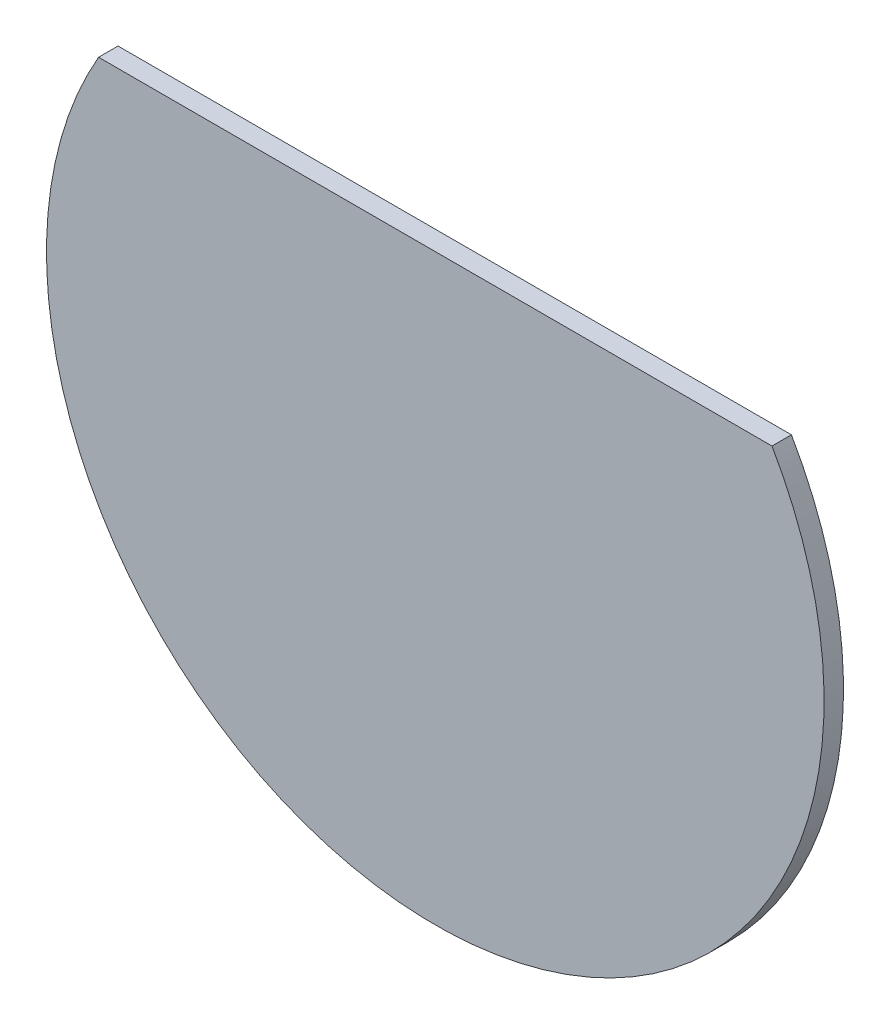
ISO-10303-21;
HEADER;
FILE_DESCRIPTION(('STEP AP214'),'2;1');
FILE_NAME('part.step','',(''),(''),'','','');
FILE_SCHEMA(('AUTOMOTIVE_DESIGN { 1 0 10303 214 1 1 1 1 }'));
ENDSEC;
DATA;
#1=APPLICATION_CONTEXT('core data for automotive mechanical design processes');
#2=APPLICATION_PROTOCOL_DEFINITION('international standard','automotive_design',2000,#1);
#3=PRODUCT_CONTEXT('',#1,'mechanical');
#4=PRODUCT('Part','Part','',(#3));
#5=PRODUCT_RELATED_PRODUCT_CATEGORY('part','',(#4));
#6=PRODUCT_DEFINITION_FORMATION('','',#4);
#7=PRODUCT_DEFINITION_CONTEXT('part definition',#1,'design');
#8=PRODUCT_DEFINITION('design','',#6,#7);
#9=PRODUCT_DEFINITION_SHAPE('','',#8);
#10=(LENGTH_UNIT() NAMED_UNIT(*) SI_UNIT(.MILLI.,.METRE.));
#11=(NAMED_UNIT(*) PLANE_ANGLE_UNIT() SI_UNIT($,.RADIAN.));
#12=(NAMED_UNIT(*) SI_UNIT($,.STERADIAN.) SOLID_ANGLE_UNIT());
#13=UNCERTAINTY_MEASURE_WITH_UNIT(LENGTH_MEASURE(1.E-05),#10,'distance_accuracy_value','');
#14=(GEOMETRIC_REPRESENTATION_CONTEXT(3) GLOBAL_UNCERTAINTY_ASSIGNED_CONTEXT((#13)) GLOBAL_UNIT_ASSIGNED_CONTEXT((#10,
#11,#12)) REPRESENTATION_CONTEXT('',''));
#15=CARTESIAN_POINT('',(0.,0.,0.));
#16=DIRECTION('',(0.,0.,1.));
#17=DIRECTION('',(1.,0.,0.));
#18=AXIS2_PLACEMENT_3D('',#15,#16,#17);
#19=CARTESIAN_POINT('',(0.,0.,6.35));
#20=DIRECTION('',(0.,0.,-1.));
#21=DIRECTION('',(-1.,0.,0.));
#22=AXIS2_PLACEMENT_3D('',#19,#20,#21);
#23=CYLINDRICAL_SURFACE('',#22,127.);
#24=CARTESIAN_POINT('',(0.,0.,0.));
#25=DIRECTION('',(0.,0.,1.));
#26=DIRECTION('',(1.,0.,0.));
#27=AXIS2_PLACEMENT_3D('',#24,#25,#26);
#28=CIRCLE('',#27,127.);
#29=CARTESIAN_POINT('',(-109.985226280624,63.5,0.));
#30=VERTEX_POINT('',#29);
#31=CARTESIAN_POINT('',(109.985226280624,63.5,0.));
#32=VERTEX_POINT('',#31);
#33=EDGE_CURVE('E64',#30,#32,#28,.T.);
#34=ORIENTED_EDGE('',*,*,#33,.T.);
#35=DIRECTION('',(0.,0.,-1.));
#36=VECTOR('',#35,1.);
#37=CARTESIAN_POINT('',(109.985226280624,63.5,6.35));
#38=LINE('',#37,#36);
#39=CARTESIAN_POINT('',(109.985226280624,63.5,6.35));
#40=VERTEX_POINT('',#39);
#41=EDGE_CURVE('E11',#40,#32,#38,.T.);
#42=ORIENTED_EDGE('',*,*,#41,.F.);
#43=CARTESIAN_POINT('',(0.,0.,6.35));
#44=DIRECTION('',(0.,0.,1.));
#45=DIRECTION('',(1.,0.,0.));
#46=AXIS2_PLACEMENT_3D('',#43,#44,#45);
#47=CIRCLE('',#46,127.);
#48=CARTESIAN_POINT('',(-109.985226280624,63.5,6.35));
#49=VERTEX_POINT('',#48);
#50=EDGE_CURVE('E63',#49,#40,#47,.T.);
#51=ORIENTED_EDGE('',*,*,#50,.F.);
#52=DIRECTION('',(0.,0.,-1.));
#53=VECTOR('',#52,1.);
#54=CARTESIAN_POINT('',(-109.985226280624,63.5,6.35));
#55=LINE('',#54,#53);
#56=EDGE_CURVE('E41',#49,#30,#55,.T.);
#57=ORIENTED_EDGE('',*,*,#56,.T.);
#58=EDGE_LOOP('',(#34,#42,#51,#57));
#59=FACE_BOUND('',#58,.T.);
#60=ADVANCED_FACE('F33',(#59),#23,.T.);
#61=CARTESIAN_POINT('',(-109.985226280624,63.5,6.35));
#62=DIRECTION('',(0.,-1.,0.));
#63=DIRECTION('',(0.,0.,-1.));
#64=AXIS2_PLACEMENT_3D('',#61,#62,#63);
#65=PLANE('',#64);
#66=DIRECTION('',(-1.,0.,0.));
#67=VECTOR('',#66,1.);
#68=CARTESIAN_POINT('',(-109.985226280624,63.5,0.));
#69=LINE('',#68,#67);
#70=EDGE_CURVE('E56',#32,#30,#69,.T.);
#71=ORIENTED_EDGE('',*,*,#70,.T.);
#72=ORIENTED_EDGE('',*,*,#56,.F.);
#73=DIRECTION('',(-1.,0.,0.));
#74=VECTOR('',#73,1.);
#75=CARTESIAN_POINT('',(-109.985226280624,63.5,6.35));
#76=LINE('',#75,#74);
#77=EDGE_CURVE('E48',#40,#49,#76,.T.);
#78=ORIENTED_EDGE('',*,*,#77,.F.);
#79=ORIENTED_EDGE('',*,*,#41,.T.);
#80=EDGE_LOOP('',(#71,#72,#78,#79));
#81=FACE_BOUND('',#80,.T.);
#82=ADVANCED_FACE('F59',(#81),#65,.F.);
#83=CARTESIAN_POINT('',(0.,0.,6.35));
#84=DIRECTION('',(0.,0.,1.));
#85=DIRECTION('',(1.,0.,0.));
#86=AXIS2_PLACEMENT_3D('',#83,#84,#85);
#87=PLANE('',#86);
#88=ORIENTED_EDGE('',*,*,#50,.T.);
#89=ORIENTED_EDGE('',*,*,#77,.T.);
#90=EDGE_LOOP('',(#88,#89));
#91=FACE_BOUND('',#90,.T.);
#92=ADVANCED_FACE('F71',(#91),#87,.T.);
#93=CARTESIAN_POINT('',(0.,0.,0.));
#94=DIRECTION('',(0.,0.,1.));
#95=DIRECTION('',(1.,0.,0.));
#96=AXIS2_PLACEMENT_3D('',#93,#94,#95);
#97=PLANE('',#96);
#98=ORIENTED_EDGE('',*,*,#33,.F.);
#99=ORIENTED_EDGE('',*,*,#70,.F.);
#100=EDGE_LOOP('',(#98,#99));
#101=FACE_BOUND('',#100,.T.);
#102=ADVANCED_FACE('F67',(#101),#97,.F.);
#103=CLOSED_SHELL('',(#60,#82,#92,#102));
#104=MANIFOLD_SOLID_BREP('B2',#103);
#105=ADVANCED_BREP_SHAPE_REPRESENTATION('',(#18,#104),#14);
#106=SHAPE_DEFINITION_REPRESENTATION(#9,#105);
ENDSEC;
END-ISO-10303-21;
